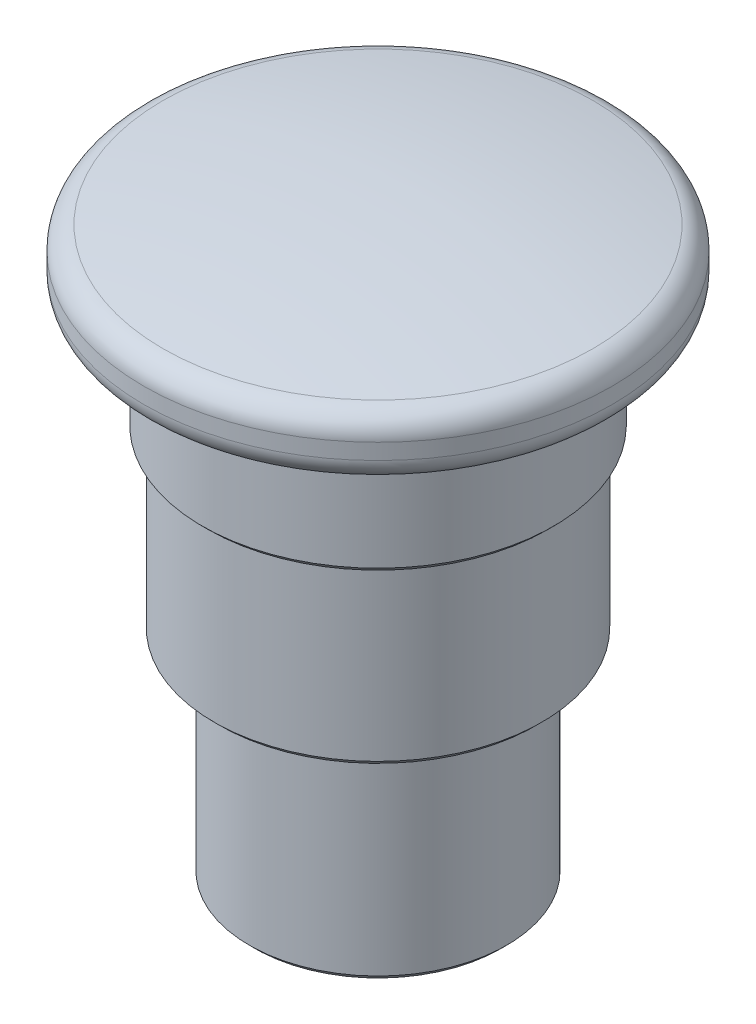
ISO-10303-21;
HEADER;
FILE_DESCRIPTION(('STEP AP214'),'2;1');
FILE_NAME('part.step','',(''),(''),'','','');
FILE_SCHEMA(('AUTOMOTIVE_DESIGN { 1 0 10303 214 1 1 1 1 }'));
ENDSEC;
DATA;
#1=APPLICATION_CONTEXT('core data for automotive mechanical design processes');
#2=APPLICATION_PROTOCOL_DEFINITION('international standard','automotive_design',2000,#1);
#3=PRODUCT_CONTEXT('',#1,'mechanical');
#4=PRODUCT('Part','Part','',(#3));
#5=PRODUCT_RELATED_PRODUCT_CATEGORY('part','',(#4));
#6=PRODUCT_DEFINITION_FORMATION('','',#4);
#7=PRODUCT_DEFINITION_CONTEXT('part definition',#1,'design');
#8=PRODUCT_DEFINITION('design','',#6,#7);
#9=PRODUCT_DEFINITION_SHAPE('','',#8);
#10=(LENGTH_UNIT() NAMED_UNIT(*) SI_UNIT(.MILLI.,.METRE.));
#11=(NAMED_UNIT(*) PLANE_ANGLE_UNIT() SI_UNIT($,.RADIAN.));
#12=(NAMED_UNIT(*) SI_UNIT($,.STERADIAN.) SOLID_ANGLE_UNIT());
#13=UNCERTAINTY_MEASURE_WITH_UNIT(LENGTH_MEASURE(1.E-05),#10,'distance_accuracy_value','');
#14=(GEOMETRIC_REPRESENTATION_CONTEXT(3) GLOBAL_UNCERTAINTY_ASSIGNED_CONTEXT((#13)) GLOBAL_UNIT_ASSIGNED_CONTEXT((#10,
#11,#12)) REPRESENTATION_CONTEXT('',''));
#15=CARTESIAN_POINT('',(0.,0.,0.));
#16=DIRECTION('',(0.,0.,1.));
#17=DIRECTION('',(1.,0.,0.));
#18=AXIS2_PLACEMENT_3D('',#15,#16,#17);
#19=CARTESIAN_POINT('',(0.,-18.,0.));
#20=DIRECTION('',(0.,1.,0.));
#21=DIRECTION('',(-1.,0.,0.));
#22=AXIS2_PLACEMENT_3D('',#19,#20,#21);
#23=PLANE('',#22);
#24=CARTESIAN_POINT('',(0.,-18.,0.));
#25=DIRECTION('',(0.,1.,0.));
#26=DIRECTION('',(-1.,0.,0.));
#27=AXIS2_PLACEMENT_3D('',#24,#25,#26);
#28=CIRCLE('',#27,10.5);
#29=CARTESIAN_POINT('',(-10.5,-18.,0.));
#30=VERTEX_POINT('',#29);
#31=EDGE_CURVE('E64',#30,#30,#28,.F.);
#32=ORIENTED_EDGE('',*,*,#31,.T.);
#33=EDGE_LOOP('',(#32));
#34=FACE_BOUND('',#33,.T.);
#35=ADVANCED_FACE('F28',(#34),#23,.F.);
#36=CARTESIAN_POINT('',(0.,39.0246656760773,0.));
#37=DIRECTION('',(0.,1.,0.));
#38=DIRECTION('',(-1.,0.,0.));
#39=AXIS2_PLACEMENT_3D('',#36,#37,#38);
#40=CYLINDRICAL_SURFACE('',#39,11.);
#41=CARTESIAN_POINT('',(0.,-17.5,0.));
#42=DIRECTION('',(0.,1.,0.));
#43=DIRECTION('',(-1.,0.,0.));
#44=AXIS2_PLACEMENT_3D('',#41,#42,#43);
#45=CIRCLE('',#44,11.);
#46=CARTESIAN_POINT('',(-11.,-17.5,0.));
#47=VERTEX_POINT('',#46);
#48=EDGE_CURVE('E66',#47,#47,#45,.T.);
#49=ORIENTED_EDGE('',*,*,#48,.T.);
#50=EDGE_LOOP('',(#49));
#51=FACE_BOUND('',#50,.T.);
#52=CARTESIAN_POINT('',(0.,0.,0.));
#53=DIRECTION('',(0.,1.,0.));
#54=DIRECTION('',(-1.,0.,0.));
#55=AXIS2_PLACEMENT_3D('',#52,#53,#54);
#56=CIRCLE('',#55,11.);
#57=CARTESIAN_POINT('',(-11.,0.,0.));
#58=VERTEX_POINT('',#57);
#59=EDGE_CURVE('E72',#58,#58,#56,.T.);
#60=ORIENTED_EDGE('',*,*,#59,.F.);
#61=EDGE_LOOP('',(#60));
#62=FACE_BOUND('',#61,.T.);
#63=ADVANCED_FACE('F55',(#51,#62),#40,.T.);
#64=CARTESIAN_POINT('',(11.,0.,0.));
#65=DIRECTION('',(0.,1.,0.));
#66=DIRECTION('',(-1.,0.,0.));
#67=AXIS2_PLACEMENT_3D('',#64,#65,#66);
#68=PLANE('',#67);
#69=CARTESIAN_POINT('',(0.,0.,0.));
#70=DIRECTION('',(0.,1.,0.));
#71=DIRECTION('',(-1.,0.,0.));
#72=AXIS2_PLACEMENT_3D('',#69,#70,#71);
#73=CIRCLE('',#72,13.5);
#74=CARTESIAN_POINT('',(-13.5,0.,0.));
#75=VERTEX_POINT('',#74);
#76=EDGE_CURVE('E69',#75,#75,#73,.F.);
#77=ORIENTED_EDGE('',*,*,#76,.T.);
#78=EDGE_LOOP('',(#77));
#79=FACE_BOUND('',#78,.T.);
#80=ORIENTED_EDGE('',*,*,#59,.T.);
#81=EDGE_LOOP('',(#80));
#82=FACE_BOUND('',#81,.T.);
#83=ADVANCED_FACE('F60',(#79,#82),#68,.F.);
#84=CARTESIAN_POINT('',(0.,39.0246656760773,0.));
#85=DIRECTION('',(0.,1.,0.));
#86=DIRECTION('',(-1.,0.,0.));
#87=AXIS2_PLACEMENT_3D('',#84,#85,#86);
#88=CYLINDRICAL_SURFACE('',#87,14.);
#89=CARTESIAN_POINT('',(0.,0.5,0.));
#90=DIRECTION('',(0.,1.,0.));
#91=DIRECTION('',(-1.,0.,0.));
#92=AXIS2_PLACEMENT_3D('',#89,#90,#91);
#93=CIRCLE('',#92,14.);
#94=CARTESIAN_POINT('',(-14.,0.499999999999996,0.));
#95=VERTEX_POINT('',#94);
#96=EDGE_CURVE('E65',#95,#95,#93,.T.);
#97=ORIENTED_EDGE('',*,*,#96,.T.);
#98=EDGE_LOOP('',(#97));
#99=FACE_BOUND('',#98,.T.);
#100=CARTESIAN_POINT('',(0.,15.,0.));
#101=DIRECTION('',(0.,1.,0.));
#102=DIRECTION('',(-1.,0.,0.));
#103=AXIS2_PLACEMENT_3D('',#100,#101,#102);
#104=CIRCLE('',#103,14.);
#105=CARTESIAN_POINT('',(-14.,15.,0.));
#106=VERTEX_POINT('',#105);
#107=EDGE_CURVE('E125',#106,#106,#104,.T.);
#108=ORIENTED_EDGE('',*,*,#107,.F.);
#109=EDGE_LOOP('',(#108));
#110=FACE_BOUND('',#109,.T.);
#111=ADVANCED_FACE('F118',(#99,#110),#88,.T.);
#112=CARTESIAN_POINT('',(14.,15.,0.));
#113=DIRECTION('',(0.,1.,0.));
#114=DIRECTION('',(-1.,0.,0.));
#115=AXIS2_PLACEMENT_3D('',#112,#113,#114);
#116=PLANE('',#115);
#117=CARTESIAN_POINT('',(0.,15.,0.));
#118=DIRECTION('',(0.,1.,0.));
#119=DIRECTION('',(-1.,0.,0.));
#120=AXIS2_PLACEMENT_3D('',#117,#118,#119);
#121=CIRCLE('',#120,14.5);
#122=CARTESIAN_POINT('',(-14.5,15.,0.));
#123=VERTEX_POINT('',#122);
#124=EDGE_CURVE('E11',#123,#123,#121,.F.);
#125=ORIENTED_EDGE('',*,*,#124,.T.);
#126=EDGE_LOOP('',(#125));
#127=FACE_BOUND('',#126,.T.);
#128=ORIENTED_EDGE('',*,*,#107,.T.);
#129=EDGE_LOOP('',(#128));
#130=FACE_BOUND('',#129,.T.);
#131=ADVANCED_FACE('F121',(#127,#130),#116,.F.);
#132=CARTESIAN_POINT('',(0.,39.0246656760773,0.));
#133=DIRECTION('',(0.,1.,0.));
#134=DIRECTION('',(-1.,0.,0.));
#135=AXIS2_PLACEMENT_3D('',#132,#133,#134);
#136=CYLINDRICAL_SURFACE('',#135,15.);
#137=CARTESIAN_POINT('',(0.,15.5,0.));
#138=DIRECTION('',(0.,1.,0.));
#139=DIRECTION('',(-1.,0.,0.));
#140=AXIS2_PLACEMENT_3D('',#137,#138,#139);
#141=CIRCLE('',#140,15.);
#142=CARTESIAN_POINT('',(-15.,15.5,0.));
#143=VERTEX_POINT('',#142);
#144=EDGE_CURVE('E34',#143,#143,#141,.T.);
#145=ORIENTED_EDGE('',*,*,#144,.T.);
#146=EDGE_LOOP('',(#145));
#147=FACE_BOUND('',#146,.T.);
#148=CARTESIAN_POINT('',(0.,25.,0.));
#149=DIRECTION('',(0.,1.,0.));
#150=DIRECTION('',(-1.,0.,0.));
#151=AXIS2_PLACEMENT_3D('',#148,#149,#150);
#152=CIRCLE('',#151,15.);
#153=CARTESIAN_POINT('',(-15.,25.,0.));
#154=VERTEX_POINT('',#153);
#155=EDGE_CURVE('E127',#154,#154,#152,.T.);
#156=ORIENTED_EDGE('',*,*,#155,.F.);
#157=EDGE_LOOP('',(#156));
#158=FACE_BOUND('',#157,.T.);
#159=ADVANCED_FACE('F91',(#147,#158),#136,.T.);
#160=CARTESIAN_POINT('',(15.,25.,0.));
#161=DIRECTION('',(0.,1.,0.));
#162=DIRECTION('',(-1.,0.,0.));
#163=AXIS2_PLACEMENT_3D('',#160,#161,#162);
#164=PLANE('',#163);
#165=CARTESIAN_POINT('',(0.,25.,0.));
#166=DIRECTION('',(0.,1.,0.));
#167=DIRECTION('',(-1.,0.,0.));
#168=AXIS2_PLACEMENT_3D('',#165,#166,#167);
#169=CIRCLE('',#168,18.);
#170=CARTESIAN_POINT('',(-18.,25.,0.));
#171=VERTEX_POINT('',#170);
#172=EDGE_CURVE('E84',#171,#171,#169,.F.);
#173=ORIENTED_EDGE('',*,*,#172,.T.);
#174=EDGE_LOOP('',(#173));
#175=FACE_BOUND('',#174,.T.);
#176=ORIENTED_EDGE('',*,*,#155,.T.);
#177=EDGE_LOOP('',(#176));
#178=FACE_BOUND('',#177,.T.);
#179=ADVANCED_FACE('F50',(#175,#178),#164,.F.);
#180=CARTESIAN_POINT('',(0.,39.0246656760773,0.));
#181=DIRECTION('',(0.,1.,0.));
#182=DIRECTION('',(-1.,0.,0.));
#183=AXIS2_PLACEMENT_3D('',#180,#181,#182);
#184=CYLINDRICAL_SURFACE('',#183,20.);
#185=CARTESIAN_POINT('',(0.,27.,0.));
#186=DIRECTION('',(0.,1.,0.));
#187=DIRECTION('',(-1.,0.,0.));
#188=AXIS2_PLACEMENT_3D('',#185,#186,#187);
#189=CIRCLE('',#188,20.);
#190=CARTESIAN_POINT('',(-20.,27.,0.));
#191=VERTEX_POINT('',#190);
#192=EDGE_CURVE('E81',#191,#191,#189,.T.);
#193=ORIENTED_EDGE('',*,*,#192,.T.);
#194=EDGE_LOOP('',(#193));
#195=FACE_BOUND('',#194,.T.);
#196=CARTESIAN_POINT('',(0.,28.3514390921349,0.));
#197=DIRECTION('',(0.,-1.,0.));
#198=DIRECTION('',(1.,0.,0.));
#199=AXIS2_PLACEMENT_3D('',#196,#197,#198);
#200=CIRCLE('',#199,20.);
#201=CARTESIAN_POINT('',(20.,28.3514390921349,0.));
#202=VERTEX_POINT('',#201);
#203=EDGE_CURVE('E78',#202,#202,#200,.T.);
#204=ORIENTED_EDGE('',*,*,#203,.T.);
#205=EDGE_LOOP('',(#204));
#206=FACE_BOUND('',#205,.T.);
#207=ADVANCED_FACE('F40',(#195,#206),#184,.T.);
#208=CARTESIAN_POINT('',(-0.100005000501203,-67.9999499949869,0.));
#209=DIRECTION('',(0.,0.,-1.));
#210=DIRECTION('',(-1.,0.,0.));
#211=AXIS2_PLACEMENT_3D('',#208,#209,#210);
#212=CIRCLE('',#211,100.);
#213=TRIMMED_CURVE('',#212,(PARAMETER_VALUE(-1.5717963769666)),
(PARAMETER_VALUE(1.5717963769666)),.T.,.PARAMETER.);
#214=CARTESIAN_POINT('',(0.,-67.9999499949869,0.));
#215=DIRECTION('',(0.,1.,0.));
#216=AXIS1_PLACEMENT('',#214,#215);
#217=SURFACE_OF_REVOLUTION('',#213,#216);
#218=CARTESIAN_POINT('',(0.,30.3177939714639,0.));
#219=DIRECTION('',(0.,-1.,0.));
#220=DIRECTION('',(1.,0.,0.));
#221=AXIS2_PLACEMENT_3D('',#218,#219,#220);
#222=CIRCLE('',#221,18.3653060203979);
#223=CARTESIAN_POINT('',(18.3653060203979,30.3177939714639,0.));
#224=VERTEX_POINT('',#223);
#225=EDGE_CURVE('E87',#224,#224,#222,.F.);
#226=ORIENTED_EDGE('',*,*,#225,.T.);
#227=EDGE_LOOP('',(#226));
#228=FACE_BOUND('',#227,.T.);
#229=CARTESIAN_POINT('',(0.,32.,0.));
#230=VERTEX_POINT('',#229);
#231=VERTEX_LOOP('',#230);
#232=FACE_BOUND('',#231,.T.);
#233=ADVANCED_FACE('F37',(#228,#232),#217,.T.);
#234=CARTESIAN_POINT('',(0.,-17.5,0.));
#235=DIRECTION('',(0.,1.,0.));
#236=DIRECTION('',(-1.,0.,0.));
#237=AXIS2_PLACEMENT_3D('',#234,#235,#236);
#238=CONICAL_SURFACE('',#237,11.,0.785398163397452);
#239=ORIENTED_EDGE('',*,*,#31,.F.);
#240=EDGE_LOOP('',(#239));
#241=FACE_BOUND('',#240,.T.);
#242=ORIENTED_EDGE('',*,*,#48,.F.);
#243=EDGE_LOOP('',(#242));
#244=FACE_BOUND('',#243,.T.);
#245=ADVANCED_FACE('F39',(#241,#244),#238,.T.);
#246=CARTESIAN_POINT('',(0.,0.5,0.));
#247=DIRECTION('',(0.,1.,0.));
#248=DIRECTION('',(-1.,0.,0.));
#249=AXIS2_PLACEMENT_3D('',#246,#247,#248);
#250=CONICAL_SURFACE('',#249,14.,0.785398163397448);
#251=ORIENTED_EDGE('',*,*,#76,.F.);
#252=EDGE_LOOP('',(#251));
#253=FACE_BOUND('',#252,.T.);
#254=ORIENTED_EDGE('',*,*,#96,.F.);
#255=EDGE_LOOP('',(#254));
#256=FACE_BOUND('',#255,.T.);
#257=ADVANCED_FACE('F47',(#253,#256),#250,.T.);
#258=CARTESIAN_POINT('',(0.,27.,0.));
#259=DIRECTION('',(0.,1.,0.));
#260=DIRECTION('',(-1.,0.,0.));
#261=AXIS2_PLACEMENT_3D('',#258,#259,#260);
#262=TOROIDAL_SURFACE('',#261,18.,2.);
#263=ORIENTED_EDGE('',*,*,#172,.F.);
#264=EDGE_LOOP('',(#263));
#265=FACE_BOUND('',#264,.T.);
#266=ORIENTED_EDGE('',*,*,#192,.F.);
#267=EDGE_LOOP('',(#266));
#268=FACE_BOUND('',#267,.T.);
#269=ADVANCED_FACE('F102',(#265,#268),#262,.T.);
#270=CARTESIAN_POINT('',(0.,28.3514390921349,0.));
#271=DIRECTION('',(0.,-1.,0.));
#272=DIRECTION('',(1.,0.,0.));
#273=AXIS2_PLACEMENT_3D('',#270,#271,#272);
#274=TOROIDAL_SURFACE('',#273,18.,2.);
#275=ORIENTED_EDGE('',*,*,#203,.F.);
#276=EDGE_LOOP('',(#275));
#277=FACE_BOUND('',#276,.T.);
#278=ORIENTED_EDGE('',*,*,#225,.F.);
#279=EDGE_LOOP('',(#278));
#280=FACE_BOUND('',#279,.T.);
#281=ADVANCED_FACE('F96',(#277,#280),#274,.T.);
#282=CARTESIAN_POINT('',(0.,15.5,0.));
#283=DIRECTION('',(0.,1.,0.));
#284=DIRECTION('',(-1.,0.,0.));
#285=AXIS2_PLACEMENT_3D('',#282,#283,#284);
#286=CONICAL_SURFACE('',#285,15.,0.785398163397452);
#287=ORIENTED_EDGE('',*,*,#124,.F.);
#288=EDGE_LOOP('',(#287));
#289=FACE_BOUND('',#288,.T.);
#290=ORIENTED_EDGE('',*,*,#144,.F.);
#291=EDGE_LOOP('',(#290));
#292=FACE_BOUND('',#291,.T.);
#293=ADVANCED_FACE('F94',(#289,#292),#286,.T.);
#294=CLOSED_SHELL('',(#35,#63,#83,#111,#131,#159,#179,#207,#233,#245,#257,#269,#281,#293));
#295=MANIFOLD_SOLID_BREP('B2',#294);
#296=ADVANCED_BREP_SHAPE_REPRESENTATION('',(#18,#295),#14);
#297=SHAPE_DEFINITION_REPRESENTATION(#9,#296);
ENDSEC;
END-ISO-10303-21;
